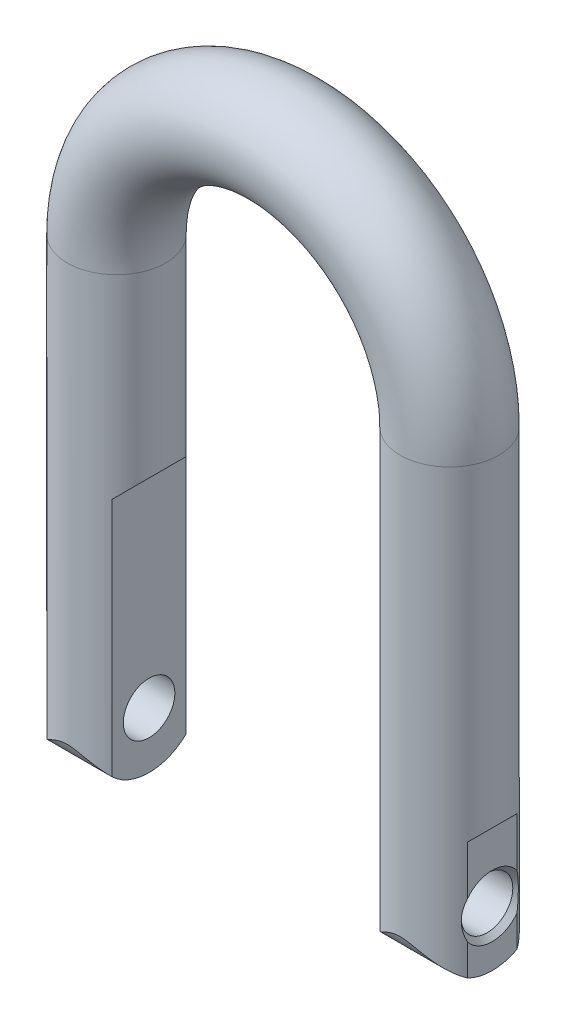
from build123d import *

# Parameters (mm, degrees)
SKETCH3_R               = 4.7625
CUT_EXTRUDE1_DEPTH      = 76.2
CUT_EXTRUDE1_DEPTH_BACK = 58.865556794
CUT_EXTRUDE2_DEPTH      = 76.2
CUT_EXTRUDE2_DEPTH_BACK = 76.2


with BuildPart() as part:
    # Base-Sweep: sweep along a path in Sketch1
    with BuildLine(Plane.XY) as base_sweep_path:
        Line((-16.0782, -53.7718), (-16.0782, 0))
        ThreePointArc((-16.0782, 0), (0, 16.0782), (16.0782, 0))
        Line((16.0782, 0), (16.0782, -53.7718))
    # Sketch3 → Base-Sweep (sweep)
    with BuildSketch(Plane(origin=(-16.0782, -53.7718, 0), x_dir=(-1, 0, 0), z_dir=(0, 1, 0))):
        Circle(SKETCH3_R)
    sweep(path=base_sweep_path.line)

    # Sketch4 → Cut-Extrude1 (cut, two sides: drawn at the far end of the back side and taken through both)
    with BuildSketch(Plane(origin=(0, 0, 0), x_dir=(0, 0, -1), z_dir=(1, 0, 0)).offset(-CUT_EXTRUDE1_DEPTH_BACK)):
        with BuildLine():
            Line((5.15874, -38.26256), (5.15874, -58.232077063))
            Line((5.15874, -58.232077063), (-5.15874, -58.232077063))
            Line((-5.15874, -58.232077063), (-5.15874, -38.26256))
            ThreePointArc((-5.15874, -38.26256), (0, -43.4213), (5.15874, -38.26256))
        make_face()
    extrude(amount=CUT_EXTRUDE1_DEPTH + CUT_EXTRUDE1_DEPTH_BACK, mode=Mode.SUBTRACT)

    # Sketch5 → Cut-Extrude2 (cut, two sides: drawn at the far end of the back side and taken through both)
    with BuildSketch(Plane.XY.offset(-CUT_EXTRUDE2_DEPTH_BACK)):
        Polygon((-12.9286, -18.7833), (-12.9286, -63.208404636), (12.9286, -63.208404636), (12.9286, -18.7833), (9.476891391, -15.331591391), (-9.476891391, -15.331591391), align=None)
        Polygon((-20.193, -31.4833), (-20.193, -63.382708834), (-29.873684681, -63.382708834), (-29.873684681, -28.243193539), (-23.433106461, -28.243193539), align=None)
        Polygon((20.193, -31.4833), (20.193, -63.382708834), (29.873684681, -63.382708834), (29.873684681, -28.243193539), (23.433106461, -28.243193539), align=None)
    extrude(amount=CUT_EXTRUDE2_DEPTH + CUT_EXTRUDE2_DEPTH_BACK, mode=Mode.SUBTRACT)

    # Sketch7 → Hole1 (revolve, cut)
    with BuildSketch(Plane(origin=(20.193, -38.0111, 0), x_dir=(0, 0, -1), z_dir=(0, 1, 0))):
        Polygon((0, 0), (0, 41.0337), (2.9845, 41.0337), (2.4892, 40.5384), (2.4892, 0.4953), (2.9845, 0), align=None)
    revolve(axis=Axis((26.543, -38.0111, 0), (-1, 0, 0)), mode=Mode.SUBTRACT)


solid = part.part
